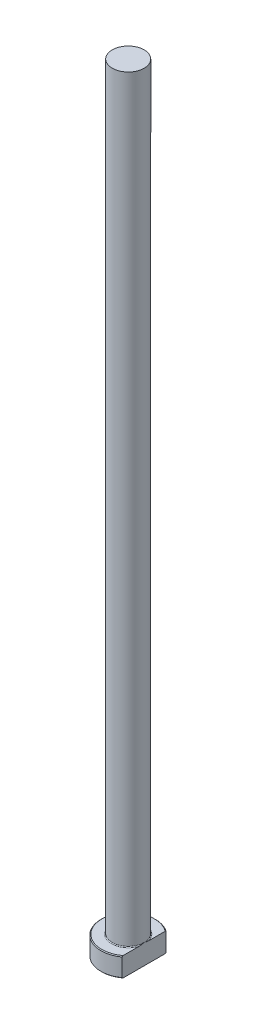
ISO-10303-21;
HEADER;
FILE_DESCRIPTION(('STEP AP214'),'2;1');
FILE_NAME('part.step','',(''),(''),'','','');
FILE_SCHEMA(('AUTOMOTIVE_DESIGN { 1 0 10303 214 1 1 1 1 }'));
ENDSEC;
DATA;
#1=APPLICATION_CONTEXT('core data for automotive mechanical design processes');
#2=APPLICATION_PROTOCOL_DEFINITION('international standard','automotive_design',2000,#1);
#3=PRODUCT_CONTEXT('',#1,'mechanical');
#4=PRODUCT('Part','Part','',(#3));
#5=PRODUCT_RELATED_PRODUCT_CATEGORY('part','',(#4));
#6=PRODUCT_DEFINITION_FORMATION('','',#4);
#7=PRODUCT_DEFINITION_CONTEXT('part definition',#1,'design');
#8=PRODUCT_DEFINITION('design','',#6,#7);
#9=PRODUCT_DEFINITION_SHAPE('','',#8);
#10=(LENGTH_UNIT() NAMED_UNIT(*) SI_UNIT(.MILLI.,.METRE.));
#11=(NAMED_UNIT(*) PLANE_ANGLE_UNIT() SI_UNIT($,.RADIAN.));
#12=(NAMED_UNIT(*) SI_UNIT($,.STERADIAN.) SOLID_ANGLE_UNIT());
#13=UNCERTAINTY_MEASURE_WITH_UNIT(LENGTH_MEASURE(1.E-05),#10,'distance_accuracy_value','');
#14=(GEOMETRIC_REPRESENTATION_CONTEXT(3) GLOBAL_UNCERTAINTY_ASSIGNED_CONTEXT((#13)) GLOBAL_UNIT_ASSIGNED_CONTEXT((#10,
#11,#12)) REPRESENTATION_CONTEXT('',''));
#15=CARTESIAN_POINT('',(0.,0.,0.));
#16=DIRECTION('',(0.,0.,1.));
#17=DIRECTION('',(1.,0.,0.));
#18=AXIS2_PLACEMENT_3D('',#15,#16,#17);
#19=CARTESIAN_POINT('',(0.,0.,0.));
#20=DIRECTION('',(0.,-1.,0.));
#21=DIRECTION('',(0.,0.,-1.));
#22=AXIS2_PLACEMENT_3D('',#19,#20,#21);
#23=PLANE('',#22);
#24=CARTESIAN_POINT('',(0.,0.,0.));
#25=DIRECTION('',(0.,-1.,0.));
#26=DIRECTION('',(0.,0.,-1.));
#27=AXIS2_PLACEMENT_3D('',#24,#25,#26);
#28=CIRCLE('',#27,6.79999999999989);
#29=CARTESIAN_POINT('',(4.09999999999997,0.,5.42494239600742));
#30=VERTEX_POINT('',#29);
#31=CARTESIAN_POINT('',(4.09999999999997,0.,-5.42494239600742));
#32=VERTEX_POINT('',#31);
#33=EDGE_CURVE('E98',#30,#32,#28,.T.);
#34=ORIENTED_EDGE('',*,*,#33,.T.);
#35=DIRECTION('',(0.,0.,1.));
#36=VECTOR('',#35,1.);
#37=CARTESIAN_POINT('',(4.09999999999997,0.,-5.6736231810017));
#38=LINE('',#37,#36);
#39=EDGE_CURVE('E83',#32,#30,#38,.T.);
#40=ORIENTED_EDGE('',*,*,#39,.T.);
#41=EDGE_LOOP('',(#34,#40));
#42=FACE_BOUND('',#41,.T.);
#43=ADVANCED_FACE('F32',(#42),#23,.T.);
#44=CARTESIAN_POINT('',(0.,259.958771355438,0.));
#45=DIRECTION('',(0.,1.,0.));
#46=DIRECTION('',(0.,0.,1.));
#47=AXIS2_PLACEMENT_3D('',#44,#45,#46);
#48=CYLINDRICAL_SURFACE('',#47,6.99999999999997);
#49=CARTESIAN_POINT('',(0.,4.79999999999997,0.));
#50=DIRECTION('',(0.,1.,0.));
#51=DIRECTION('',(0.,0.,1.));
#52=AXIS2_PLACEMENT_3D('',#49,#50,#51);
#53=CIRCLE('',#52,6.99999999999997);
#54=CARTESIAN_POINT('',(4.09999999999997,4.79999999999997,5.6736231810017));
#55=VERTEX_POINT('',#54);
#56=CARTESIAN_POINT('',(4.09999999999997,4.79999999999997,-5.6736231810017));
#57=VERTEX_POINT('',#56);
#58=EDGE_CURVE('E104',#55,#57,#53,.F.);
#59=ORIENTED_EDGE('',*,*,#58,.T.);
#60=DIRECTION('',(0.,-1.,0.));
#61=VECTOR('',#60,1.);
#62=CARTESIAN_POINT('',(4.09999999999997,200.,-5.6736231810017));
#63=LINE('',#62,#61);
#64=CARTESIAN_POINT('',(4.09999999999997,0.200000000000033,-5.6736231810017));
#65=VERTEX_POINT('',#64);
#66=EDGE_CURVE('E183',#57,#65,#63,.T.);
#67=ORIENTED_EDGE('',*,*,#66,.T.);
#68=CARTESIAN_POINT('',(0.,0.200000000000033,0.));
#69=DIRECTION('',(0.,-1.,0.));
#70=DIRECTION('',(0.,0.,-1.));
#71=AXIS2_PLACEMENT_3D('',#68,#69,#70);
#72=CIRCLE('',#71,6.99999999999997);
#73=CARTESIAN_POINT('',(4.09999999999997,0.200000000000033,5.6736231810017));
#74=VERTEX_POINT('',#73);
#75=EDGE_CURVE('E100',#65,#74,#72,.F.);
#76=ORIENTED_EDGE('',*,*,#75,.T.);
#77=DIRECTION('',(0.,-1.,0.));
#78=VECTOR('',#77,1.);
#79=CARTESIAN_POINT('',(4.09999999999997,200.,5.6736231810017));
#80=LINE('',#79,#78);
#81=EDGE_CURVE('E93',#55,#74,#80,.T.);
#82=ORIENTED_EDGE('',*,*,#81,.F.);
#83=EDGE_LOOP('',(#59,#67,#76,#82));
#84=FACE_BOUND('',#83,.T.);
#85=ADVANCED_FACE('F158',(#84),#48,.T.);
#86=CARTESIAN_POINT('',(-6.99999999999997,5.,0.));
#87=DIRECTION('',(0.,1.,0.));
#88=DIRECTION('',(0.,0.,1.));
#89=AXIS2_PLACEMENT_3D('',#86,#87,#88);
#90=PLANE('',#89);
#91=CARTESIAN_POINT('',(0.,5.,0.));
#92=DIRECTION('',(0.,1.,0.));
#93=DIRECTION('',(0.,0.,1.));
#94=AXIS2_PLACEMENT_3D('',#91,#92,#93);
#95=CIRCLE('',#94,6.79999999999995);
#96=CARTESIAN_POINT('',(4.09999999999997,5.,-5.4249423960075));
#97=VERTEX_POINT('',#96);
#98=CARTESIAN_POINT('',(4.09999999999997,5.,5.4249423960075));
#99=VERTEX_POINT('',#98);
#100=EDGE_CURVE('E178',#97,#99,#95,.T.);
#101=ORIENTED_EDGE('',*,*,#100,.T.);
#102=DIRECTION('',(0.,0.,-1.));
#103=VECTOR('',#102,1.);
#104=CARTESIAN_POINT('',(4.09999999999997,5.,0.));
#105=LINE('',#104,#103);
#106=CARTESIAN_POINT('',(4.09999999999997,4.99999999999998,1.29614813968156));
#107=VERTEX_POINT('',#106);
#108=EDGE_CURVE('E57',#99,#107,#105,.T.);
#109=ORIENTED_EDGE('',*,*,#108,.T.);
#110=CARTESIAN_POINT('',(0.,5.,0.));
#111=DIRECTION('',(0.,1.,0.));
#112=DIRECTION('',(0.,0.,1.));
#113=AXIS2_PLACEMENT_3D('',#110,#111,#112);
#114=CIRCLE('',#113,4.29999999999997);
#115=CARTESIAN_POINT('',(4.09999999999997,4.99999999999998,-1.29614813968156));
#116=VERTEX_POINT('',#115);
#117=EDGE_CURVE('E107',#107,#116,#114,.F.);
#118=ORIENTED_EDGE('',*,*,#117,.T.);
#119=EDGE_CURVE('E136',#116,#97,#105,.T.);
#120=ORIENTED_EDGE('',*,*,#119,.T.);
#121=EDGE_LOOP('',(#101,#109,#118,#120));
#122=FACE_BOUND('',#121,.T.);
#123=ADVANCED_FACE('F147',(#122),#90,.T.);
#124=CARTESIAN_POINT('',(0.,5.,0.));
#125=DIRECTION('',(0.,-1.,0.));
#126=DIRECTION('',(0.,0.,-1.));
#127=AXIS2_PLACEMENT_3D('',#124,#125,#126);
#128=CONICAL_SURFACE('',#127,6.79999999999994,0.785398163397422);
#129=ORIENTED_EDGE('',*,*,#58,.F.);
#130=CARTESIAN_POINT('',(4.09999999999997,-1.33929192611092,12.483228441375));
#131=CARTESIAN_POINT('',(4.09999999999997,-1.13691180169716,12.2702073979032));
#132=CARTESIAN_POINT('',(4.09999999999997,-0.934791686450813,12.0569390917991));
#133=CARTESIAN_POINT('',(4.09999999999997,-0.531169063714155,11.6298164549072));
#134=CARTESIAN_POINT('',(4.09999999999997,-0.329666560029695,11.4159621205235));
#135=CARTESIAN_POINT('',(4.09999999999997,0.273965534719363,10.7731725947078));
#136=CARTESIAN_POINT('',(4.09999999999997,0.675017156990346,10.3432236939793));
#137=CARTESIAN_POINT('',(4.09999999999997,1.47875431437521,9.47345436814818));
#138=CARTESIAN_POINT('',(4.09999999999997,1.88138218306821,9.03358046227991));
#139=CARTESIAN_POINT('',(4.09999999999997,2.48056970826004,8.36963259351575));
#140=CARTESIAN_POINT('',(4.09999999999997,2.67946853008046,8.14767042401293));
#141=CARTESIAN_POINT('',(4.09999999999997,3.07530374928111,7.70200314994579));
#142=CARTESIAN_POINT('',(4.09999999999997,3.27224016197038,7.47829805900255));
#143=CARTESIAN_POINT('',(4.09999999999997,3.62803580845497,7.06959504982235));
#144=CARTESIAN_POINT('',(4.09999999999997,3.78730687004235,6.88495594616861));
#145=CARTESIAN_POINT('',(4.09999999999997,4.10378434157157,6.51391771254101));
#146=CARTESIAN_POINT('',(4.09999999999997,4.26099077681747,6.32751860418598));
#147=CARTESIAN_POINT('',(4.09999999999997,4.57299335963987,5.95235210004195));
#148=CARTESIAN_POINT('',(4.09999999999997,4.72778657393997,5.7635822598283));
#149=CARTESIAN_POINT('',(4.09999999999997,5.03405385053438,5.38337519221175));
#150=CARTESIAN_POINT('',(4.09999999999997,5.18552806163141,5.191938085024));
#151=CARTESIAN_POINT('',(4.09999999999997,5.48381165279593,4.80616050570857));
#152=CARTESIAN_POINT('',(4.09999999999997,5.6306310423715,4.61182780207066));
#153=CARTESIAN_POINT('',(4.09999999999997,5.91857329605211,4.21889561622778));
#154=CARTESIAN_POINT('',(4.09999999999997,6.05969490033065,4.02029520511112));
#155=CARTESIAN_POINT('',(4.09999999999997,6.33384612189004,3.61807653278));
#156=CARTESIAN_POINT('',(4.09999999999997,6.46688994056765,3.41446801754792));
#157=CARTESIAN_POINT('',(4.09999999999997,6.7219628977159,3.00051329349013));
#158=CARTESIAN_POINT('',(4.09999999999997,6.84399822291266,2.79017096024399));
#159=CARTESIAN_POINT('',(4.09999999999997,7.042948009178,2.41613627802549));
#160=CARTESIAN_POINT('',(4.09999999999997,7.12340018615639,2.25434092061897));
#161=CARTESIAN_POINT('',(4.09999999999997,7.27278814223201,1.92538984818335));
#162=CARTESIAN_POINT('',(4.09999999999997,7.34172134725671,1.75823294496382));
#163=CARTESIAN_POINT('',(4.09999999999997,7.4639506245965,1.41984946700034));
#164=CARTESIAN_POINT('',(4.09999999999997,7.51737823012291,1.24867129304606));
#165=CARTESIAN_POINT('',(4.09999999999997,7.6053948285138,0.901532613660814));
#166=CARTESIAN_POINT('',(4.09999999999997,7.63999996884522,0.725576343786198));
#167=CARTESIAN_POINT('',(4.09999999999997,7.68036353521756,0.421086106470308));
#168=CARTESIAN_POINT('',(4.09999999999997,7.69152054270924,0.293260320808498));
#169=CARTESIAN_POINT('',(4.09999999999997,7.70182627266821,0.0371280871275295));
#170=CARTESIAN_POINT('',(4.09999999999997,7.7009769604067,-0.0911782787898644));
#171=CARTESIAN_POINT('',(4.09999999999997,7.68730446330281,-0.347367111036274));
#172=CARTESIAN_POINT('',(4.09999999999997,7.67446010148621,-0.475248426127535));
#173=CARTESIAN_POINT('',(4.09999999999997,7.63752967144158,-0.729373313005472));
#174=CARTESIAN_POINT('',(4.09999999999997,7.61344101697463,-0.85561650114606));
#175=CARTESIAN_POINT('',(4.09999999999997,7.54404317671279,-1.15392625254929));
#176=CARTESIAN_POINT('',(4.09999999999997,7.49413451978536,-1.32492035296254));
#177=CARTESIAN_POINT('',(4.09999999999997,7.37892989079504,-1.66161692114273));
#178=CARTESIAN_POINT('',(4.09999999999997,7.31362410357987,-1.82731593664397));
#179=CARTESIAN_POINT('',(4.09999999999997,7.17079959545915,-2.15435858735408));
#180=CARTESIAN_POINT('',(4.09999999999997,7.09321727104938,-2.31567410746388));
#181=CARTESIAN_POINT('',(4.09999999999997,6.97004119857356,-2.55403843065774));
#182=CARTESIAN_POINT('',(4.09999999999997,6.92785402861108,-2.63288278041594));
#183=CARTESIAN_POINT('',(4.09999999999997,6.84148468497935,-2.78946923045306));
#184=CARTESIAN_POINT('',(4.09999999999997,6.7973025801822,-2.8672113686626));
#185=CARTESIAN_POINT('',(4.09999999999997,6.65934609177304,-3.1037224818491));
#186=CARTESIAN_POINT('',(4.09999999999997,6.56274427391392,-3.26084376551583));
#187=CARTESIAN_POINT('',(4.09999999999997,6.36389133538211,-3.5714843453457));
#188=CARTESIAN_POINT('',(4.09999999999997,6.26163896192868,-3.72500283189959));
#189=CARTESIAN_POINT('',(4.09999999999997,6.05267831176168,-4.02913378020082));
#190=CARTESIAN_POINT('',(4.09999999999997,5.94596678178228,-4.17974399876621));
#191=CARTESIAN_POINT('',(4.09999999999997,5.72908222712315,-4.47845767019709));
#192=CARTESIAN_POINT('',(4.09999999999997,5.61890895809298,-4.62656094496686));
#193=CARTESIAN_POINT('',(4.09999999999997,5.39553225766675,-4.9210193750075));
#194=CARTESIAN_POINT('',(4.09999999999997,5.28232219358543,-5.06736948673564));
#195=CARTESIAN_POINT('',(4.09999999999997,5.05364560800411,-5.35829836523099));
#196=CARTESIAN_POINT('',(4.09999999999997,4.93817902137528,-5.50287708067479));
#197=CARTESIAN_POINT('',(4.09999999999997,4.58900487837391,-5.93440610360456));
#198=CARTESIAN_POINT('',(4.09999999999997,4.35254037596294,-6.21912657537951));
#199=CARTESIAN_POINT('',(4.09999999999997,3.99368021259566,-6.64336157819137));
#200=CARTESIAN_POINT('',(4.09999999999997,3.8731886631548,-6.78450136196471));
#201=CARTESIAN_POINT('',(4.09999999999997,3.63111125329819,-7.06582575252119));
#202=CARTESIAN_POINT('',(4.09999999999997,3.50952545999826,-7.20601041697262));
#203=CARTESIAN_POINT('',(4.09999999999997,3.14334067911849,-7.6253764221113));
#204=CARTESIAN_POINT('',(4.09999999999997,2.89734299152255,-7.90333600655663));
#205=CARTESIAN_POINT('',(4.09999999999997,2.40293836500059,-8.45636150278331));
#206=CARTESIAN_POINT('',(4.09999999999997,2.15453550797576,-8.73143107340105));
#207=CARTESIAN_POINT('',(4.09999999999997,1.65560568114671,-9.27963529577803));
#208=CARTESIAN_POINT('',(4.09999999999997,1.40507871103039,-9.55276994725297));
#209=CARTESIAN_POINT('',(4.09999999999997,0.947239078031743,-10.0488717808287));
#210=CARTESIAN_POINT('',(4.09999999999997,0.740197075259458,-10.2720890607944));
#211=CARTESIAN_POINT('',(4.09999999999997,0.325116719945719,-10.7177199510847));
#212=CARTESIAN_POINT('',(4.09999999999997,0.117078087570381,-10.940133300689));
#213=CARTESIAN_POINT('',(4.09999999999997,-0.298674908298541,-11.3830462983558));
#214=CARTESIAN_POINT('',(4.09999999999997,-0.506385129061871,-11.6035498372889));
#215=CARTESIAN_POINT('',(4.09999999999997,-0.922403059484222,-12.0438652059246));
#216=CARTESIAN_POINT('',(4.09999999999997,-1.13071056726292,-12.2636772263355));
#217=CARTESIAN_POINT('',(4.09999999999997,-1.33929192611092,-12.483228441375));
#218=B_SPLINE_CURVE_WITH_KNOTS('',3,(#130,#131,#132,#133,#134,#135,#136,#137,#138,#139,#140,
#141,#142,#143,#144,#145,#146,#147,#148,#149,#150,#151,#152,#153,#154,#155,#156,#157,#158,#159,
#160,#161,#162,#163,#164,#165,#166,#167,#168,#169,#170,#171,#172,#173,#174,#175,#176,#177,#178,
#179,#180,#181,#182,#183,#184,#185,#186,#187,#188,#189,#190,#191,#192,#193,#194,#195,#196,#197,
#198,#199,#200,#201,#202,#203,#204,#205,#206,#207,#208,#209,#210,#211,#212,#213,#214,#215,#216,
#217),.UNSPECIFIED.,.F.,.F.,(4,2,2,2,2,2,2,2,2,2,2,2,2,2,2,2,2,2,2,2,2,2,2,2,2,2,2,2,2,2,2,2,2,
2,2,2,2,2,2,2,2,2,2,4),(0.,0.881487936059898,1.76298129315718,3.52684938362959,5.31576438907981,
6.20987642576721,7.10398148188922,7.83549529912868,8.5670001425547,9.29933394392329,
10.0316348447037,10.7622363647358,11.4929985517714,12.2224363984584,12.9514617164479,
13.4932089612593,14.0350771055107,14.5722044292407,15.1088702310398,15.4932846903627,
15.8776362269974,16.2626676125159,16.6477876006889,17.1811942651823,17.7149418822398,
18.2515512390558,18.5197937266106,18.7880269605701,19.3411787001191,19.8944535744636,
20.448139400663,21.0018643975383,21.5569172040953,22.1119860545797,23.2222096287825,
23.7789368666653,24.335630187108,25.4491497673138,26.5610293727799,27.6729091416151,
28.5862688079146,29.4999020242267,30.4086844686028,31.3171893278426),.UNSPECIFIED.);
#219=EDGE_CURVE('E135',#55,#99,#218,.T.);
#220=ORIENTED_EDGE('',*,*,#219,.T.);
#221=ORIENTED_EDGE('',*,*,#100,.F.);
#222=EDGE_CURVE('E127',#97,#57,#218,.T.);
#223=ORIENTED_EDGE('',*,*,#222,.T.);
#224=EDGE_LOOP('',(#129,#220,#221,#223));
#225=FACE_BOUND('',#224,.T.);
#226=ADVANCED_FACE('F143',(#225),#128,.T.);
#227=CARTESIAN_POINT('',(0.,0.200000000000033,0.));
#228=DIRECTION('',(0.,1.,0.));
#229=DIRECTION('',(0.,0.,1.));
#230=AXIS2_PLACEMENT_3D('',#227,#228,#229);
#231=CONICAL_SURFACE('',#230,6.99999999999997,0.785398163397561);
#232=ORIENTED_EDGE('',*,*,#75,.F.);
#233=CARTESIAN_POINT('',(4.09999999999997,6.33929192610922,-12.483228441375));
#234=CARTESIAN_POINT('',(4.09999999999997,6.13691180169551,-12.2702073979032));
#235=CARTESIAN_POINT('',(4.09999999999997,5.93479168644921,-12.0569390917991));
#236=CARTESIAN_POINT('',(4.09999999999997,5.53116906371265,-11.6298164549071));
#237=CARTESIAN_POINT('',(4.09999999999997,5.32966656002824,-11.4159621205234));
#238=CARTESIAN_POINT('',(4.09999999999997,4.72603446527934,-10.7731725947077));
#239=CARTESIAN_POINT('',(4.09999999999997,4.32498284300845,-10.3432236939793));
#240=CARTESIAN_POINT('',(4.09999999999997,3.52124568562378,-9.47345436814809));
#241=CARTESIAN_POINT('',(4.09999999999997,3.11861781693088,-9.0335804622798));
#242=CARTESIAN_POINT('',(4.09999999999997,2.5194302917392,-8.36963259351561));
#243=CARTESIAN_POINT('',(4.09999999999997,2.32053146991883,-8.14767042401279));
#244=CARTESIAN_POINT('',(4.09999999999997,1.92469625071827,-7.70200314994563));
#245=CARTESIAN_POINT('',(4.09999999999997,1.72775983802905,-7.47829805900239));
#246=CARTESIAN_POINT('',(4.09999999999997,1.37196419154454,-7.06959504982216));
#247=CARTESIAN_POINT('',(4.09999999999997,1.2126931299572,-6.88495594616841));
#248=CARTESIAN_POINT('',(4.09999999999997,0.896215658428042,-6.51391771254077));
#249=CARTESIAN_POINT('',(4.09999999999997,0.739009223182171,-6.32751860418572));
#250=CARTESIAN_POINT('',(4.09999999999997,0.42700664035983,-5.95235210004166));
#251=CARTESIAN_POINT('',(4.09999999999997,0.272213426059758,-5.76358225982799));
#252=CARTESIAN_POINT('',(4.09999999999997,-0.0340538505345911,-5.38337519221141));
#253=CARTESIAN_POINT('',(4.09999999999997,-0.18552806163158,-5.19193808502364));
#254=CARTESIAN_POINT('',(4.09999999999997,-0.483811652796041,-4.80616050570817));
#255=CARTESIAN_POINT('',(4.09999999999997,-0.630631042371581,-4.61182780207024));
#256=CARTESIAN_POINT('',(4.09999999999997,-0.918573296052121,-4.21889561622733));
#257=CARTESIAN_POINT('',(4.09999999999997,-1.05969490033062,-4.02029520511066));
#258=CARTESIAN_POINT('',(4.09999999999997,-1.33384612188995,-3.61807653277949));
#259=CARTESIAN_POINT('',(4.09999999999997,-1.46688994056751,-3.4144680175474));
#260=CARTESIAN_POINT('',(4.09999999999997,-1.72196289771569,-3.00051329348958));
#261=CARTESIAN_POINT('',(4.09999999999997,-1.8439982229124,-2.79017096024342));
#262=CARTESIAN_POINT('',(4.09999999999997,-2.04294800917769,-2.41613627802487));
#263=CARTESIAN_POINT('',(4.09999999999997,-2.12340018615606,-2.2543409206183));
#264=CARTESIAN_POINT('',(4.09999999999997,-2.27278814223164,-1.92538984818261));
#265=CARTESIAN_POINT('',(4.09999999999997,-2.34172134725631,-1.75823294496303));
#266=CARTESIAN_POINT('',(4.09999999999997,-2.46395062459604,-1.41984946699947));
#267=CARTESIAN_POINT('',(4.09999999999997,-2.51737823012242,-1.24867129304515));
#268=CARTESIAN_POINT('',(4.09999999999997,-2.60539482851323,-0.901532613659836));
#269=CARTESIAN_POINT('',(4.09999999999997,-2.63999996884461,-0.725576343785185));
#270=CARTESIAN_POINT('',(4.09999999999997,-2.68036353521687,-0.421086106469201));
#271=CARTESIAN_POINT('',(4.09999999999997,-2.69152054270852,-0.293260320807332));
#272=CARTESIAN_POINT('',(4.09999999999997,-2.70182627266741,-0.0371280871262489));
#273=CARTESIAN_POINT('',(4.09999999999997,-2.70097696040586,0.0911782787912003));
#274=CARTESIAN_POINT('',(4.09999999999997,-2.68730446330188,0.347367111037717));
#275=CARTESIAN_POINT('',(4.09999999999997,-2.67446010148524,0.47524842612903));
#276=CARTESIAN_POINT('',(4.09999999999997,-2.63752967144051,0.729373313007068));
#277=CARTESIAN_POINT('',(4.09999999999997,-2.61344101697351,0.855616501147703));
#278=CARTESIAN_POINT('',(4.09999999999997,-2.54404317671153,1.15392625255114));
#279=CARTESIAN_POINT('',(4.09999999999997,-2.494134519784,1.32492035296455));
#280=CARTESIAN_POINT('',(4.09999999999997,-2.37892989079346,1.66161692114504));
#281=CARTESIAN_POINT('',(4.09999999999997,-2.31362410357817,1.82731593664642));
#282=CARTESIAN_POINT('',(4.09999999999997,-2.17079959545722,2.15435858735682));
#283=CARTESIAN_POINT('',(4.09999999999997,-2.09321727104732,2.31567410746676));
#284=CARTESIAN_POINT('',(4.09999999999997,-1.97004119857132,2.55403843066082));
#285=CARTESIAN_POINT('',(4.09999999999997,-1.92785402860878,2.63288278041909));
#286=CARTESIAN_POINT('',(4.09999999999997,-1.84148468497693,2.78946923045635));
#287=CARTESIAN_POINT('',(4.09999999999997,-1.79730258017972,2.86721136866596));
#288=CARTESIAN_POINT('',(4.09999999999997,-1.65934609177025,3.10372248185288));
#289=CARTESIAN_POINT('',(4.09999999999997,-1.56274427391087,3.26084376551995));
#290=CARTESIAN_POINT('',(4.09999999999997,-1.36389133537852,3.5714843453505));
#291=CARTESIAN_POINT('',(4.09999999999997,-1.26163896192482,3.72500283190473));
#292=CARTESIAN_POINT('',(4.09999999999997,-1.05267831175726,4.02913378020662));
#293=CARTESIAN_POINT('',(4.09999999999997,-0.945966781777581,4.17974399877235));
#294=CARTESIAN_POINT('',(4.09999999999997,-0.729082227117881,4.47845767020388));
#295=CARTESIAN_POINT('',(4.09999999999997,-0.618908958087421,4.62656094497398));
#296=CARTESIAN_POINT('',(4.09999999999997,-0.395532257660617,4.92101937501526));
#297=CARTESIAN_POINT('',(4.09999999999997,-0.282322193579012,5.06736948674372));
#298=CARTESIAN_POINT('',(4.09999999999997,-0.0536456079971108,5.35829836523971));
#299=CARTESIAN_POINT('',(4.09999999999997,0.0618209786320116,5.50287708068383));
#300=CARTESIAN_POINT('',(4.09999999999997,0.410995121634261,5.93440610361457));
#301=CARTESIAN_POINT('',(4.09999999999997,0.64745962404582,6.21912657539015));
#302=CARTESIAN_POINT('',(4.09999999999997,1.00631978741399,6.64336157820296));
#303=CARTESIAN_POINT('',(4.09999999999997,1.12681133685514,6.78450136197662));
#304=CARTESIAN_POINT('',(4.09999999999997,1.36888874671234,7.06582575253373));
#305=CARTESIAN_POINT('',(4.09999999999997,1.49047454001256,7.20601041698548));
#306=CARTESIAN_POINT('',(4.09999999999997,1.8566593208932,7.6253764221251));
#307=CARTESIAN_POINT('',(4.09999999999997,2.10265700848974,7.90333600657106));
#308=CARTESIAN_POINT('',(4.09999999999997,2.59706163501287,8.45636150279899));
#309=CARTESIAN_POINT('',(4.09999999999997,2.84546449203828,8.73143107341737));
#310=CARTESIAN_POINT('',(4.09999999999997,3.3443943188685,9.27963529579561));
#311=CARTESIAN_POINT('',(4.09999999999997,3.5949212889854,9.55276994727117));
#312=CARTESIAN_POINT('',(4.09999999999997,4.05276092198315,10.0488717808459));
#313=CARTESIAN_POINT('',(4.09999999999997,4.25980292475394,10.27208906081));
#314=CARTESIAN_POINT('',(4.09999999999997,4.67488328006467,10.7177199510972));
#315=CARTESIAN_POINT('',(4.09999999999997,4.8829219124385,10.9401333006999));
#316=CARTESIAN_POINT('',(4.09999999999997,5.2986749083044,11.3830462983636));
#317=CARTESIAN_POINT('',(4.09999999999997,5.50638512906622,11.603549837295));
#318=CARTESIAN_POINT('',(4.09999999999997,5.92240305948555,12.0438652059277));
#319=CARTESIAN_POINT('',(4.09999999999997,6.13071056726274,12.263677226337));
#320=CARTESIAN_POINT('',(4.09999999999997,6.33929192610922,12.483228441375));
#321=B_SPLINE_CURVE_WITH_KNOTS('',3,(#233,#234,#235,#236,#237,#238,#239,#240,#241,#242,#243,
#244,#245,#246,#247,#248,#249,#250,#251,#252,#253,#254,#255,#256,#257,#258,#259,#260,#261,#262,
#263,#264,#265,#266,#267,#268,#269,#270,#271,#272,#273,#274,#275,#276,#277,#278,#279,#280,#281,
#282,#283,#284,#285,#286,#287,#288,#289,#290,#291,#292,#293,#294,#295,#296,#297,#298,#299,#300,
#301,#302,#303,#304,#305,#306,#307,#308,#309,#310,#311,#312,#313,#314,#315,#316,#317,#318,#319,
#320),.UNSPECIFIED.,.F.,.F.,(4,2,2,2,2,2,2,2,2,2,2,2,2,2,2,2,2,2,2,2,2,2,2,2,2,2,2,2,2,2,2,2,2,
2,2,2,2,2,2,2,2,2,2,4),(0.,0.88148793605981,1.76298129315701,3.52684938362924,5.31576438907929,
6.20987642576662,7.10398148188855,7.83549529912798,8.56700014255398,9.29933394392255,
10.031634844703,10.762236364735,11.4929985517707,12.2224363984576,12.9514617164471,
13.4932089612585,14.03507710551,14.5722044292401,15.1088702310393,15.4932846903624,
15.8776362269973,16.2626676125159,16.6477876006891,17.181194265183,17.7149418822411,
18.2515512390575,18.5197937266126,18.7880269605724,19.3411787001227,19.8944535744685,
20.4481394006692,21.0018643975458,21.5569172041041,22.1119860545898,23.2222096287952,
23.7789368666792,24.3356301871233,25.4491497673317,26.5610293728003,27.6729091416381,
28.5862688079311,29.4999020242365,30.4086844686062,31.3171893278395),.UNSPECIFIED.);
#322=EDGE_CURVE('E86',#65,#32,#321,.T.);
#323=ORIENTED_EDGE('',*,*,#322,.T.);
#324=ORIENTED_EDGE('',*,*,#33,.F.);
#325=EDGE_CURVE('E89',#30,#74,#321,.T.);
#326=ORIENTED_EDGE('',*,*,#325,.T.);
#327=EDGE_LOOP('',(#232,#323,#324,#326));
#328=FACE_BOUND('',#327,.T.);
#329=ADVANCED_FACE('F97',(#328),#231,.T.);
#330=CARTESIAN_POINT('',(0.,5.19999999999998,0.));
#331=DIRECTION('',(0.,1.,0.));
#332=DIRECTION('',(0.,0.,1.));
#333=AXIS2_PLACEMENT_3D('',#330,#331,#332);
#334=TOROIDAL_SURFACE('',#333,4.29999999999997,0.2);
#335=CARTESIAN_POINT('',(4.09999999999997,5.19999999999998,0.));
#336=CARTESIAN_POINT('',(4.09999999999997,5.20000051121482,8.48177579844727E-11));
#337=CARTESIAN_POINT('',(4.09999999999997,5.2000010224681,-2.37341874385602E-07));
#338=CARTESIAN_POINT('',(4.09999999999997,5.20000197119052,-8.69991321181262E-07));
#339=CARTESIAN_POINT('',(4.09999999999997,5.20000238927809,-1.28223494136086E-06));
#340=CARTESIAN_POINT('',(4.09999999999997,5.20000327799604,-2.27653388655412E-06));
#341=CARTESIAN_POINT('',(4.09999999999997,5.20000373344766,-2.87471299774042E-06));
#342=CARTESIAN_POINT('',(4.09999999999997,5.20000453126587,-4.09830357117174E-06));
#343=CARTESIAN_POINT('',(4.09999999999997,5.20000487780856,-4.72126748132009E-06));
#344=CARTESIAN_POINT('',(4.09999999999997,5.20000620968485,-7.19543436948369E-06));
#345=CARTESIAN_POINT('',(4.09999999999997,5.20000713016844,-9.08507628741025E-06));
#346=CARTESIAN_POINT('',(4.09999999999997,5.20000860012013,-1.27786167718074E-05));
#347=CARTESIAN_POINT('',(4.09999999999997,5.2000091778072,-1.45716794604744E-05));
#348=CARTESIAN_POINT('',(4.09999999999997,5.20001167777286,-2.23278313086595E-05));
#349=CARTESIAN_POINT('',(4.09999999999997,5.20001360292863,-2.82919348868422E-05));
#350=CARTESIAN_POINT('',(4.09999999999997,5.20001636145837,-3.94393207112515E-05));
#351=CARTESIAN_POINT('',(4.09999999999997,5.20001732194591,-4.459065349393E-05));
#352=CARTESIAN_POINT('',(4.09999999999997,5.20002443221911,-8.33481274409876E-05));
#353=CARTESIAN_POINT('',(4.09999999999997,5.20002995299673,-0.000117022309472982));
#354=CARTESIAN_POINT('',(4.09999999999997,5.20005411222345,-0.000250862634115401));
#355=CARTESIAN_POINT('',(4.09999999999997,5.20007702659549,-0.000350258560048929));
#356=CARTESIAN_POINT('',(4.09999999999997,5.20016686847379,-0.000745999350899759));
#357=CARTESIAN_POINT('',(4.09999999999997,5.20023113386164,-0.00104273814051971));
#358=CARTESIAN_POINT('',(4.09999999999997,5.20048975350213,-0.00222871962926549));
#359=CARTESIAN_POINT('',(4.09999999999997,5.20068752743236,-0.00311743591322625));
#360=CARTESIAN_POINT('',(4.09999999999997,5.20151360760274,-0.00683863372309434));
#361=CARTESIAN_POINT('',(4.09999999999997,5.20213761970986,-0.00967177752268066));
#362=CARTESIAN_POINT('',(4.09999999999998,5.21060513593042,-0.0481053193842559));
#363=CARTESIAN_POINT('',(4.09999999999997,5.21847514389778,-0.0837019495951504));
#364=CARTESIAN_POINT('',(4.09999999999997,5.23497753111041,-0.15888321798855));
#365=CARTESIAN_POINT('',(4.09999999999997,5.24359721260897,-0.198470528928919));
#366=CARTESIAN_POINT('',(4.09999999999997,5.25810552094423,-0.266014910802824));
#367=CARTESIAN_POINT('',(4.09999999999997,5.26405008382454,-0.293959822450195));
#368=CARTESIAN_POINT('',(4.09999999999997,5.27562355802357,-0.34912552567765));
#369=CARTESIAN_POINT('',(4.09999999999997,5.28125665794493,-0.376345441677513));
#370=CARTESIAN_POINT('',(4.09999999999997,5.29943979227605,-0.46575599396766));
#371=CARTESIAN_POINT('',(4.09999999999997,5.31159607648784,-0.528028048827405));
#372=CARTESIAN_POINT('',(4.09999999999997,5.3345183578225,-0.653452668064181));
#373=CARTESIAN_POINT('',(4.09999999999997,5.34526982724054,-0.716607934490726));
#374=CARTESIAN_POINT('',(4.09999999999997,5.36549989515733,-0.849208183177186));
#375=CARTESIAN_POINT('',(4.09999999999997,5.37476398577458,-0.918686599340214));
#376=CARTESIAN_POINT('',(4.09999999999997,5.38955225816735,-1.05786044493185));
#377=CARTESIAN_POINT('',(4.09999999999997,5.39508786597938,-1.12755454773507));
#378=CARTESIAN_POINT('',(4.09999999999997,5.3992964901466,-1.23112590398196));
#379=CARTESIAN_POINT('',(4.09999999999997,5.40003705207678,-1.26491756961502));
#380=CARTESIAN_POINT('',(4.09999999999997,5.39995996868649,-1.33249559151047));
#381=CARTESIAN_POINT('',(4.09999999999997,5.39914270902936,-1.36628194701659));
#382=CARTESIAN_POINT('',(4.09999999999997,5.39557880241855,-1.43339843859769));
#383=CARTESIAN_POINT('',(4.09999999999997,5.39285312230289,-1.46672955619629));
#384=CARTESIAN_POINT('',(4.09999999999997,5.3849220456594,-1.53304911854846));
#385=CARTESIAN_POINT('',(4.09999999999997,5.37972044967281,-1.56603800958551));
#386=CARTESIAN_POINT('',(4.09999999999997,5.36576321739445,-1.63210333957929));
#387=CARTESIAN_POINT('',(4.09999999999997,5.35693238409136,-1.66516593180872));
#388=CARTESIAN_POINT('',(4.09999999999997,5.33956496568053,-1.71313701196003));
#389=CARTESIAN_POINT('',(4.09999999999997,5.33312382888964,-1.72879572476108));
#390=CARTESIAN_POINT('',(4.09999999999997,5.31841020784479,-1.75921181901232));
#391=CARTESIAN_POINT('',(4.09999999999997,5.31014484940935,-1.77397243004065));
#392=CARTESIAN_POINT('',(4.09999999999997,5.29597609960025,-1.79459137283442));
#393=CARTESIAN_POINT('',(4.09999999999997,5.29105059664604,-1.80111732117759));
#394=CARTESIAN_POINT('',(4.09999999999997,5.28047159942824,-1.81356806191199));
#395=CARTESIAN_POINT('',(4.09999999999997,5.27481806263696,-1.81949281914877));
#396=CARTESIAN_POINT('',(4.09999999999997,5.26378662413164,-1.82942177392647));
#397=CARTESIAN_POINT('',(4.09999999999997,5.25854825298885,-1.83357893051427));
#398=CARTESIAN_POINT('',(4.09999999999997,5.24747881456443,-1.8410175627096));
#399=CARTESIAN_POINT('',(4.09999999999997,5.24164898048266,-1.84430081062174));
#400=CARTESIAN_POINT('',(4.09999999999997,5.23103019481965,-1.84897077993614));
#401=CARTESIAN_POINT('',(4.09999999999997,5.22636142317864,-1.85062832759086));
#402=CARTESIAN_POINT('',(4.09999999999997,5.21681344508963,-1.85314556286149));
#403=CARTESIAN_POINT('',(4.09999999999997,5.21193447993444,-1.85400614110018));
#404=CARTESIAN_POINT('',(4.09999999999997,5.2020790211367,-1.8548454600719));
#405=CARTESIAN_POINT('',(4.09999999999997,5.19710220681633,-1.85482052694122));
#406=CARTESIAN_POINT('',(4.09999999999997,5.18723254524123,-1.85388227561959));
#407=CARTESIAN_POINT('',(4.09999999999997,5.18233974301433,-1.8529684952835));
#408=CARTESIAN_POINT('',(4.09999999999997,5.17301169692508,-1.85041011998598));
#409=CARTESIAN_POINT('',(4.09999999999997,5.16856577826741,-1.84880345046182));
#410=CARTESIAN_POINT('',(4.09999999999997,5.15994310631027,-1.84499014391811));
#411=CARTESIAN_POINT('',(4.09999999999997,5.15576643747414,-1.84278331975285));
#412=CARTESIAN_POINT('',(4.09999999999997,5.1448604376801,-1.83616140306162));
#413=CARTESIAN_POINT('',(4.09999999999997,5.13841060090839,-1.8312871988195));
#414=CARTESIAN_POINT('',(4.09999999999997,5.12632402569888,-1.82061430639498));
#415=CARTESIAN_POINT('',(4.09999999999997,5.12069027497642,-1.81481237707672));
#416=CARTESIAN_POINT('',(4.09999999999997,5.10569835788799,-1.79748307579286));
#417=CARTESIAN_POINT('',(4.09999999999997,5.0971810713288,-1.78523612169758));
#418=CARTESIAN_POINT('',(4.09999999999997,5.08190874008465,-1.759730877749));
#419=CARTESIAN_POINT('',(4.09999999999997,5.07515617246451,-1.74647119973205));
#420=CARTESIAN_POINT('',(4.09999999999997,5.06057670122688,-1.71404296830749));
#421=CARTESIAN_POINT('',(4.09999999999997,5.05336936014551,-1.69459894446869));
#422=CARTESIAN_POINT('',(4.09999999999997,5.04078670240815,-1.65511361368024));
#423=CARTESIAN_POINT('',(4.09999999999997,5.03541518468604,-1.63507116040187));
#424=CARTESIAN_POINT('',(4.09999999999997,5.02602669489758,-1.59438056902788));
#425=CARTESIAN_POINT('',(4.09999999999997,5.02202979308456,-1.57372787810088));
#426=CARTESIAN_POINT('',(4.09999999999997,5.01520764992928,-1.53226128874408));
#427=CARTESIAN_POINT('',(4.09999999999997,5.01238102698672,-1.51144761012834));
#428=CARTESIAN_POINT('',(4.09999999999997,5.00618826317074,-1.45642510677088));
#429=CARTESIAN_POINT('',(4.09999999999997,5.00362476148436,-1.42212636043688));
#430=CARTESIAN_POINT('',(4.09999999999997,5.00045800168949,-1.35343324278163));
#431=CARTESIAN_POINT('',(4.09999999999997,4.99985588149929,-1.31903882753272));
#432=CARTESIAN_POINT('',(4.09999999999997,5.00037893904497,-1.21560964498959));
#433=CARTESIAN_POINT('',(4.09999999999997,5.00385566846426,-1.14658832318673));
#434=CARTESIAN_POINT('',(4.09999999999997,5.01464295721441,-1.01357004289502));
#435=CARTESIAN_POINT('',(4.09999999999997,5.02167983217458,-0.949547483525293));
#436=CARTESIAN_POINT('',(4.09999999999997,5.03833051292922,-0.822416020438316));
#437=CARTESIAN_POINT('',(4.09999999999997,5.04792112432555,-0.759304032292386));
#438=CARTESIAN_POINT('',(4.09999999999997,5.06649836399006,-0.648156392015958));
#439=CARTESIAN_POINT('',(4.09999999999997,5.07509963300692,-0.60005440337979));
#440=CARTESIAN_POINT('',(4.09999999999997,5.09336865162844,-0.5027171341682));
#441=CARTESIAN_POINT('',(4.09999999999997,5.10305882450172,-0.45348607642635));
#442=CARTESIAN_POINT('',(4.09999999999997,5.12010265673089,-0.369650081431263));
#443=CARTESIAN_POINT('',(4.09999999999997,5.1273025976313,-0.335013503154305));
#444=CARTESIAN_POINT('',(4.09999999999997,5.14184386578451,-0.26617579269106));
#445=CARTESIAN_POINT('',(4.09999999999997,5.14918270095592,-0.231974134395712));
#446=CARTESIAN_POINT('',(4.09999999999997,5.16314314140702,-0.167541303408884));
#447=CARTESIAN_POINT('',(4.09999999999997,5.16974991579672,-0.137306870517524));
#448=CARTESIAN_POINT('',(4.09999999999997,5.18332308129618,-0.0755506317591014));
#449=CARTESIAN_POINT('',(4.09999999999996,5.19029270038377,-0.0440294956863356));
#450=CARTESIAN_POINT('',(4.09999999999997,5.19786353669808,-0.00966658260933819));
#451=CARTESIAN_POINT('',(4.09999999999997,5.19848867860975,-0.00682823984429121));
#452=CARTESIAN_POINT('',(4.09999999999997,5.19931502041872,-0.00310588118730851));
#453=CARTESIAN_POINT('',(4.09999999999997,5.19951189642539,-0.00222119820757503));
#454=CARTESIAN_POINT('',(4.09999999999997,5.19976942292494,-0.00104022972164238));
#455=CARTESIAN_POINT('',(4.09999999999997,5.19983347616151,-0.000744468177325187));
#456=CARTESIAN_POINT('',(4.09999999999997,5.19992306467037,-0.000349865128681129));
#457=CARTESIAN_POINT('',(4.09999999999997,5.1999459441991,-0.000250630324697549));
#458=CARTESIAN_POINT('',(4.09999999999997,5.19997007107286,-0.000116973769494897));
#459=CARTESIAN_POINT('',(4.09999999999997,5.19997558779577,-8.33211280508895E-05));
#460=CARTESIAN_POINT('',(4.09999999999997,5.19998268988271,-4.45857715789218E-05));
#461=CARTESIAN_POINT('',(4.09999999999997,5.19998364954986,-3.94355404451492E-05));
#462=CARTESIAN_POINT('',(4.09999999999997,5.19998640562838,-2.82904942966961E-05));
#463=CARTESIAN_POINT('',(4.09999999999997,5.19998832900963,-2.23275713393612E-05));
#464=CARTESIAN_POINT('',(4.09999999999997,5.19999082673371,-1.45726655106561E-05));
#465=CARTESIAN_POINT('',(4.09999999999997,5.19999140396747,-1.27796833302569E-05));
#466=CARTESIAN_POINT('',(4.09999999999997,5.19999287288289,-9.08623741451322E-06));
#467=CARTESIAN_POINT('',(4.09999999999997,5.19999379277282,-7.19659802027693E-06));
#468=CARTESIAN_POINT('',(4.09999999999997,5.19999512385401,-4.72235852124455E-06));
#469=CARTESIAN_POINT('',(4.09999999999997,5.1999954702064,-4.0993503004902E-06));
#470=CARTESIAN_POINT('',(4.09999999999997,5.19999626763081,-2.87563677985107E-06));
#471=CARTESIAN_POINT('',(4.09999999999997,5.19999672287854,-2.2773772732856E-06));
#472=CARTESIAN_POINT('',(4.09999999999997,5.19999761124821,-1.28289389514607E-06));
#473=CARTESIAN_POINT('',(4.09999999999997,5.19999802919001,-8.70554048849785E-07));
#474=CARTESIAN_POINT('',(4.09999999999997,5.19999897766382,-2.3765555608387E-07));
#475=CARTESIAN_POINT('',(4.09999999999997,5.19999948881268,-8.48131903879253E-11));
#476=CARTESIAN_POINT('',(4.09999999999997,5.19999999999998,0.));
#477=B_SPLINE_CURVE_WITH_KNOTS('',3,(#335,#336,#337,#338,#339,#340,#341,#342,#343,#344,#345,
#346,#347,#348,#349,#350,#351,#352,#353,#354,#355,#356,#357,#358,#359,#360,#361,#362,#363,#364,
#365,#366,#367,#368,#369,#370,#371,#372,#373,#374,#375,#376,#377,#378,#379,#380,#381,#382,#383,
#384,#385,#386,#387,#388,#389,#390,#391,#392,#393,#394,#395,#396,#397,#398,#399,#400,#401,#402,
#403,#404,#405,#406,#407,#408,#409,#410,#411,#412,#413,#414,#415,#416,#417,#418,#419,#420,#421,
#422,#423,#424,#425,#426,#427,#428,#429,#430,#431,#432,#433,#434,#435,#436,#437,#438,#439,#440,
#441,#442,#443,#444,#445,#446,#447,#448,#449,#450,#451,#452,#453,#454,#455,#456,#457,#458,#459,
#460,#461,#462,#463,#464,#465,#466,#467,#468,#469,#470,#471,#472,#473,#474,#475,#476),
.UNSPECIFIED.,.T.,.F.,(4,2,2,2,2,2,2,2,2,2,2,2,2,2,2,2,2,2,2,2,2,2,2,2,2,2,2,2,2,2,2,2,2,2,2,2,
2,2,2,2,2,2,2,2,2,2,2,2,2,2,2,2,2,2,2,2,2,2,2,2,2,2,2,2,2,2,2,2,2,2,4),(0.,1.56077961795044E-06,
3.3330233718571E-06,5.57220089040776E-06,7.71031786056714E-06,1.39959462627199E-05,
1.96420817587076E-05,3.84177478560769E-05,5.41207073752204E-05,0.000156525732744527,
0.000462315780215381,0.00137340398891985,0.00410448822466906,0.0128079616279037,
0.122174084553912,0.243719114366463,0.329429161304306,0.41281904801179,0.603149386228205,
0.795314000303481,1.0055338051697,1.21510641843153,1.31647802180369,1.41782453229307,
1.51807472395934,1.61817152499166,1.72045618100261,1.77118252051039,1.82171411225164,
1.84620451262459,1.87069634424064,1.89069743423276,1.91065764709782,1.92546132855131,
1.94024844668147,1.9550969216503,1.96995312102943,1.98408278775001,1.99821686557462,
2.02232905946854,2.04652741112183,2.09102796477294,2.13559065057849,2.19765435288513,
2.25984571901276,2.32290998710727,2.38589958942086,2.489000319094,2.59216085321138,
2.79925959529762,2.99242441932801,3.18389136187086,3.33047882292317,3.48099951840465,
3.58712985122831,3.69206963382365,3.78491369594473,3.88175875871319,3.89047819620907,
3.89319688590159,3.89410497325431,3.89441026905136,3.8945126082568,3.89452830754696,
3.8945470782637,3.89455272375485,3.89455900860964,3.89456114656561,3.89456338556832,
3.8945651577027,3.89456671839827),.UNSPECIFIED.);
#478=CARTESIAN_POINT('',(4.09999999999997,5.19999999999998,0.));
#479=VERTEX_POINT('',#478);
#480=EDGE_CURVE('E11',#116,#479,#477,.T.);
#481=ORIENTED_EDGE('',*,*,#480,.F.);
#482=ORIENTED_EDGE('',*,*,#117,.F.);
#483=CARTESIAN_POINT('',(4.09999999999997,5.19999999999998,0.));
#484=CARTESIAN_POINT('',(4.09999999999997,5.19999948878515,-8.48181322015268E-11));
#485=CARTESIAN_POINT('',(4.09999999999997,5.19999897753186,2.37341874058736E-07));
#486=CARTESIAN_POINT('',(4.09999999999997,5.19999802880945,8.69991321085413E-07));
#487=CARTESIAN_POINT('',(4.09999999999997,5.19999761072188,1.28223494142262E-06));
#488=CARTESIAN_POINT('',(4.09999999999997,5.19999672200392,2.27653388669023E-06));
#489=CARTESIAN_POINT('',(4.09999999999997,5.1999962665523,2.874712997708E-06));
#490=CARTESIAN_POINT('',(4.09999999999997,5.19999546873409,4.0983035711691E-06));
#491=CARTESIAN_POINT('',(4.09999999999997,5.1999951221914,4.72126748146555E-06));
#492=CARTESIAN_POINT('',(4.09999999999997,5.19999379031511,7.19543437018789E-06));
#493=CARTESIAN_POINT('',(4.09999999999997,5.19999286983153,9.0850762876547E-06));
#494=CARTESIAN_POINT('',(4.09999999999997,5.19999139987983,1.27786167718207E-05));
#495=CARTESIAN_POINT('',(4.09999999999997,5.19999082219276,1.45716794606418E-05));
#496=CARTESIAN_POINT('',(4.09999999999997,5.1999883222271,2.2327831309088E-05));
#497=CARTESIAN_POINT('',(4.09999999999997,5.19998639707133,2.82919348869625E-05));
#498=CARTESIAN_POINT('',(4.09999999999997,5.19998363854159,3.94393207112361E-05));
#499=CARTESIAN_POINT('',(4.09999999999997,5.19998267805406,4.45906534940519E-05));
#500=CARTESIAN_POINT('',(4.09999999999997,5.19997556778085,8.33481274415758E-05));
#501=CARTESIAN_POINT('',(4.09999999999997,5.19997004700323,0.000117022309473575));
#502=CARTESIAN_POINT('',(4.09999999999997,5.19994588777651,0.000250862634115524));
#503=CARTESIAN_POINT('',(4.09999999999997,5.19992297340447,0.000350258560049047));
#504=CARTESIAN_POINT('',(4.09999999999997,5.19983313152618,0.000745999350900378));
#505=CARTESIAN_POINT('',(4.09999999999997,5.19976886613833,0.00104273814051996));
#506=CARTESIAN_POINT('',(4.09999999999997,5.19951024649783,0.00222871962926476));
#507=CARTESIAN_POINT('',(4.09999999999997,5.1993124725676,0.00311743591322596));
#508=CARTESIAN_POINT('',(4.09999999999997,5.19848639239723,0.00683863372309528));
#509=CARTESIAN_POINT('',(4.09999999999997,5.19786238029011,0.0096717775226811));
#510=CARTESIAN_POINT('',(4.09999999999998,5.18939486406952,0.0481053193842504));
#511=CARTESIAN_POINT('',(4.09999999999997,5.18152485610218,0.0837019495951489));
#512=CARTESIAN_POINT('',(4.09999999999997,5.16502246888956,0.158883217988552));
#513=CARTESIAN_POINT('',(4.09999999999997,5.156402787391,0.19847052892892));
#514=CARTESIAN_POINT('',(4.09999999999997,5.14189447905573,0.266014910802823));
#515=CARTESIAN_POINT('',(4.09999999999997,5.13594991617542,0.293959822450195));
#516=CARTESIAN_POINT('',(4.09999999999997,5.12437644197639,0.34912552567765));
#517=CARTESIAN_POINT('',(4.09999999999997,5.11874334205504,0.376345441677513));
#518=CARTESIAN_POINT('',(4.09999999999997,5.10056020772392,0.46575599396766));
#519=CARTESIAN_POINT('',(4.09999999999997,5.08840392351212,0.528028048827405));
#520=CARTESIAN_POINT('',(4.09999999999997,5.06548164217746,0.65345266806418));
#521=CARTESIAN_POINT('',(4.09999999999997,5.05473017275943,0.716607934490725));
#522=CARTESIAN_POINT('',(4.09999999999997,5.03450010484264,0.849208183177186));
#523=CARTESIAN_POINT('',(4.09999999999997,5.02523601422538,0.918686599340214));
#524=CARTESIAN_POINT('',(4.09999999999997,5.01044774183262,1.05786044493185));
#525=CARTESIAN_POINT('',(4.09999999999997,5.00491213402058,1.12755454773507));
#526=CARTESIAN_POINT('',(4.09999999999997,5.00070350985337,1.23112590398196));
#527=CARTESIAN_POINT('',(4.09999999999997,4.99996294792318,1.26491756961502));
#528=CARTESIAN_POINT('',(4.09999999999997,5.00004003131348,1.33249559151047));
#529=CARTESIAN_POINT('',(4.09999999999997,5.00085729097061,1.36628194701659));
#530=CARTESIAN_POINT('',(4.09999999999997,5.00442119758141,1.43339843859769));
#531=CARTESIAN_POINT('',(4.09999999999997,5.00714687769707,1.46672955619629));
#532=CARTESIAN_POINT('',(4.09999999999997,5.01507795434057,1.53304911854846));
#533=CARTESIAN_POINT('',(4.09999999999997,5.02027955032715,1.56603800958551));
#534=CARTESIAN_POINT('',(4.09999999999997,5.03423678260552,1.63210333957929));
#535=CARTESIAN_POINT('',(4.09999999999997,5.04306761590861,1.66516593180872));
#536=CARTESIAN_POINT('',(4.09999999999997,5.06043503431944,1.71313701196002));
#537=CARTESIAN_POINT('',(4.09999999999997,5.06687617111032,1.72879572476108));
#538=CARTESIAN_POINT('',(4.09999999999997,5.08158979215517,1.75921181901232));
#539=CARTESIAN_POINT('',(4.09999999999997,5.08985515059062,1.77397243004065));
#540=CARTESIAN_POINT('',(4.09999999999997,5.10402390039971,1.79459137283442));
#541=CARTESIAN_POINT('',(4.09999999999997,5.10894940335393,1.8011173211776));
#542=CARTESIAN_POINT('',(4.09999999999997,5.11952840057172,1.81356806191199));
#543=CARTESIAN_POINT('',(4.09999999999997,5.12518193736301,1.81949281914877));
#544=CARTESIAN_POINT('',(4.09999999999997,5.13621337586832,1.82942177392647));
#545=CARTESIAN_POINT('',(4.09999999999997,5.14145174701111,1.83357893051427));
#546=CARTESIAN_POINT('',(4.09999999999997,5.15252118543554,1.8410175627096));
#547=CARTESIAN_POINT('',(4.09999999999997,5.1583510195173,1.84430081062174));
#548=CARTESIAN_POINT('',(4.09999999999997,5.16896980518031,1.84897077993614));
#549=CARTESIAN_POINT('',(4.09999999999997,5.17363857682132,1.85062832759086));
#550=CARTESIAN_POINT('',(4.09999999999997,5.18318655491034,1.85314556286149));
#551=CARTESIAN_POINT('',(4.09999999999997,5.18806552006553,1.85400614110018));
#552=CARTESIAN_POINT('',(4.09999999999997,5.19792097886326,1.8548454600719));
#553=CARTESIAN_POINT('',(4.09999999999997,5.20289779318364,1.85482052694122));
#554=CARTESIAN_POINT('',(4.09999999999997,5.21276745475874,1.85388227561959));
#555=CARTESIAN_POINT('',(4.09999999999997,5.21766025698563,1.8529684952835));
#556=CARTESIAN_POINT('',(4.09999999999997,5.22698830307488,1.85041011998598));
#557=CARTESIAN_POINT('',(4.09999999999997,5.23143422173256,1.84880345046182));
#558=CARTESIAN_POINT('',(4.09999999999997,5.2400568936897,1.84499014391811));
#559=CARTESIAN_POINT('',(4.09999999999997,5.24423356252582,1.84278331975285));
#560=CARTESIAN_POINT('',(4.09999999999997,5.25513956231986,1.83616140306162));
#561=CARTESIAN_POINT('',(4.09999999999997,5.26158939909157,1.8312871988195));
#562=CARTESIAN_POINT('',(4.09999999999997,5.27367597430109,1.82061430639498));
#563=CARTESIAN_POINT('',(4.09999999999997,5.27930972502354,1.81481237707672));
#564=CARTESIAN_POINT('',(4.09999999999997,5.29430164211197,1.79748307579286));
#565=CARTESIAN_POINT('',(4.09999999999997,5.30281892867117,1.78523612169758));
#566=CARTESIAN_POINT('',(4.09999999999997,5.31809125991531,1.759730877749));
#567=CARTESIAN_POINT('',(4.09999999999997,5.32484382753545,1.74647119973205));
#568=CARTESIAN_POINT('',(4.09999999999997,5.33942329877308,1.71404296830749));
#569=CARTESIAN_POINT('',(4.09999999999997,5.34663063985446,1.69459894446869));
#570=CARTESIAN_POINT('',(4.09999999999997,5.35921329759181,1.65511361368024));
#571=CARTESIAN_POINT('',(4.09999999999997,5.36458481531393,1.63507116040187));
#572=CARTESIAN_POINT('',(4.09999999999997,5.37397330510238,1.59438056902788));
#573=CARTESIAN_POINT('',(4.09999999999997,5.3779702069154,1.57372787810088));
#574=CARTESIAN_POINT('',(4.09999999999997,5.38479235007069,1.53226128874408));
#575=CARTESIAN_POINT('',(4.09999999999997,5.38761897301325,1.51144761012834));
#576=CARTESIAN_POINT('',(4.09999999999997,5.39381173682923,1.45642510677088));
#577=CARTESIAN_POINT('',(4.09999999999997,5.3963752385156,1.42212636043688));
#578=CARTESIAN_POINT('',(4.09999999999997,5.39954199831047,1.35343324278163));
#579=CARTESIAN_POINT('',(4.09999999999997,5.40014411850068,1.31903882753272));
#580=CARTESIAN_POINT('',(4.09999999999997,5.39962106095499,1.21560964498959));
#581=CARTESIAN_POINT('',(4.09999999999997,5.3961443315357,1.14658832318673));
#582=CARTESIAN_POINT('',(4.09999999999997,5.38535704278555,1.01357004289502));
#583=CARTESIAN_POINT('',(4.09999999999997,5.37832016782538,0.949547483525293));
#584=CARTESIAN_POINT('',(4.09999999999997,5.36166948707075,0.822416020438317));
#585=CARTESIAN_POINT('',(4.09999999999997,5.35207887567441,0.759304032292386));
#586=CARTESIAN_POINT('',(4.09999999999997,5.33350163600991,0.648156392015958));
#587=CARTESIAN_POINT('',(4.09999999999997,5.32490036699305,0.60005440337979));
#588=CARTESIAN_POINT('',(4.09999999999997,5.30663134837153,0.5027171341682));
#589=CARTESIAN_POINT('',(4.09999999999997,5.29694117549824,0.453486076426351));
#590=CARTESIAN_POINT('',(4.09999999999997,5.27989734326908,0.369650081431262));
#591=CARTESIAN_POINT('',(4.09999999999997,5.27269740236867,0.335013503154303));
#592=CARTESIAN_POINT('',(4.09999999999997,5.25815613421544,0.266175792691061));
#593=CARTESIAN_POINT('',(4.09999999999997,5.25081729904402,0.231974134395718));
#594=CARTESIAN_POINT('',(4.09999999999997,5.23685685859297,0.167541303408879));
#595=CARTESIAN_POINT('',(4.09999999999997,5.23025008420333,0.137306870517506));
#596=CARTESIAN_POINT('',(4.09999999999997,5.21667691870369,0.0755506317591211));
#597=CARTESIAN_POINT('',(4.09999999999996,5.20970729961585,0.0440294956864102));
#598=CARTESIAN_POINT('',(4.09999999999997,5.20213646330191,0.00966658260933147));
#599=CARTESIAN_POINT('',(4.09999999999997,5.20151132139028,0.00682823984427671));
#600=CARTESIAN_POINT('',(4.09999999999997,5.20068497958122,0.00310588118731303));
#601=CARTESIAN_POINT('',(4.09999999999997,5.20048810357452,0.00222119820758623));
#602=CARTESIAN_POINT('',(4.09999999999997,5.20023057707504,0.00104022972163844));
#603=CARTESIAN_POINT('',(4.09999999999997,5.2001665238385,0.000744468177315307));
#604=CARTESIAN_POINT('',(4.09999999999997,5.20007693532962,0.000349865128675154));
#605=CARTESIAN_POINT('',(4.09999999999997,5.20005405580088,0.000250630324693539));
#606=CARTESIAN_POINT('',(4.09999999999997,5.20002992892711,0.000116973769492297));
#607=CARTESIAN_POINT('',(4.09999999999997,5.20002441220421,8.33211280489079E-05));
#608=CARTESIAN_POINT('',(4.09999999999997,5.20001731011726,4.45857715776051E-05));
#609=CARTESIAN_POINT('',(4.09999999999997,5.20001635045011,3.94355404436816E-05));
#610=CARTESIAN_POINT('',(4.09999999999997,5.20001359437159,2.82904942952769E-05));
#611=CARTESIAN_POINT('',(4.09999999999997,5.20001167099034,2.23275713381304E-05));
#612=CARTESIAN_POINT('',(4.09999999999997,5.20000917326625,1.45726655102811E-05));
#613=CARTESIAN_POINT('',(4.09999999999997,5.2000085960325,1.27796833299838E-05));
#614=CARTESIAN_POINT('',(4.09999999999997,5.20000712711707,9.08623741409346E-06));
#615=CARTESIAN_POINT('',(4.09999999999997,5.20000620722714,7.19659801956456E-06));
#616=CARTESIAN_POINT('',(4.09999999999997,5.20000487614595,4.72235852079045E-06));
#617=CARTESIAN_POINT('',(4.09999999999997,5.20000452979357,4.09935030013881E-06));
#618=CARTESIAN_POINT('',(4.09999999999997,5.20000373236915,2.875636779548E-06));
#619=CARTESIAN_POINT('',(4.09999999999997,5.20000327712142,2.27737727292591E-06));
#620=CARTESIAN_POINT('',(4.09999999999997,5.20000238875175,1.28289389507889E-06));
#621=CARTESIAN_POINT('',(4.09999999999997,5.20000197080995,8.7055404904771E-07));
#622=CARTESIAN_POINT('',(4.09999999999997,5.20000102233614,2.37655556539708E-07));
#623=CARTESIAN_POINT('',(4.09999999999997,5.20000051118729,8.48135644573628E-11));
#624=CARTESIAN_POINT('',(4.09999999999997,5.19999999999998,0.));
#625=B_SPLINE_CURVE_WITH_KNOTS('',3,(#483,#484,#485,#486,#487,#488,#489,#490,#491,#492,#493,
#494,#495,#496,#497,#498,#499,#500,#501,#502,#503,#504,#505,#506,#507,#508,#509,#510,#511,#512,
#513,#514,#515,#516,#517,#518,#519,#520,#521,#522,#523,#524,#525,#526,#527,#528,#529,#530,#531,
#532,#533,#534,#535,#536,#537,#538,#539,#540,#541,#542,#543,#544,#545,#546,#547,#548,#549,#550,
#551,#552,#553,#554,#555,#556,#557,#558,#559,#560,#561,#562,#563,#564,#565,#566,#567,#568,#569,
#570,#571,#572,#573,#574,#575,#576,#577,#578,#579,#580,#581,#582,#583,#584,#585,#586,#587,#588,
#589,#590,#591,#592,#593,#594,#595,#596,#597,#598,#599,#600,#601,#602,#603,#604,#605,#606,#607,
#608,#609,#610,#611,#612,#613,#614,#615,#616,#617,#618,#619,#620,#621,#622,#623,#624),
.UNSPECIFIED.,.T.,.F.,(4,2,2,2,2,2,2,2,2,2,2,2,2,2,2,2,2,2,2,2,2,2,2,2,2,2,2,2,2,2,2,2,2,2,2,2,
2,2,2,2,2,2,2,2,2,2,2,2,2,2,2,2,2,2,2,2,2,2,2,2,2,2,2,2,2,2,2,2,2,2,4),(0.,1.56077961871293E-06,
3.33302337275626E-06,5.5722008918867E-06,7.71031786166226E-06,1.3995946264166E-05,
1.9642081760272E-05,3.84177478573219E-05,5.41207073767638E-05,0.000156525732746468,
0.00046231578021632,0.00137340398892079,0.00410448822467,0.0128079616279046,0.122174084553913,
0.243719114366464,0.329429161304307,0.412819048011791,0.603149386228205,0.795314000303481,
1.0055338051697,1.21510641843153,1.31647802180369,1.41782453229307,1.51807472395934,
1.61817152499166,1.72045618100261,1.77118252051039,1.82171411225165,1.8462045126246,
1.87069634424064,1.89069743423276,1.91065764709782,1.92546132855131,1.94024844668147,
1.9550969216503,1.96995312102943,1.98408278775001,1.99821686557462,2.02232905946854,
2.04652741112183,2.09102796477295,2.13559065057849,2.19765435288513,2.25984571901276,
2.32290998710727,2.38589958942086,2.489000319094,2.59216085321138,2.79925959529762,
2.99242441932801,3.18389136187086,3.33047882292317,3.48099951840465,3.58712985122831,
3.69206963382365,3.78491369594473,3.88175875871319,3.89047819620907,3.89319688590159,
3.89410497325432,3.89441026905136,3.8945126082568,3.89452830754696,3.8945470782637,
3.89455272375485,3.89455900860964,3.89456114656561,3.89456338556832,3.89456515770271,
3.89456671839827),.UNSPECIFIED.);
#626=EDGE_CURVE('E46',#479,#107,#625,.T.);
#627=ORIENTED_EDGE('',*,*,#626,.F.);
#628=CARTESIAN_POINT('',(0.,5.19999999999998,0.));
#629=DIRECTION('',(0.,1.,0.));
#630=DIRECTION('',(0.,0.,1.));
#631=AXIS2_PLACEMENT_3D('',#628,#629,#630);
#632=CIRCLE('',#631,4.09999999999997);
#633=EDGE_CURVE('E103',#479,#479,#632,.T.);
#634=ORIENTED_EDGE('',*,*,#633,.F.);
#635=EDGE_LOOP('',(#481,#482,#627,#634));
#636=FACE_BOUND('',#635,.T.);
#637=ADVANCED_FACE('F34',(#636),#334,.F.);
#638=CARTESIAN_POINT('',(0.,259.958771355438,0.));
#639=DIRECTION('',(0.,1.,0.));
#640=DIRECTION('',(0.,0.,1.));
#641=AXIS2_PLACEMENT_3D('',#638,#639,#640);
#642=CYLINDRICAL_SURFACE('',#641,4.09999999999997);
#643=ORIENTED_EDGE('',*,*,#633,.T.);
#644=EDGE_LOOP('',(#643));
#645=FACE_BOUND('',#644,.T.);
#646=CARTESIAN_POINT('',(0.,200.,0.));
#647=DIRECTION('',(0.,1.,0.));
#648=DIRECTION('',(0.,0.,1.));
#649=AXIS2_PLACEMENT_3D('',#646,#647,#648);
#650=CIRCLE('',#649,4.09999999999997);
#651=CARTESIAN_POINT('',(0.,200.,4.09999999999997));
#652=VERTEX_POINT('',#651);
#653=EDGE_CURVE('E101',#652,#652,#650,.T.);
#654=ORIENTED_EDGE('',*,*,#653,.F.);
#655=EDGE_LOOP('',(#654));
#656=FACE_BOUND('',#655,.T.);
#657=ADVANCED_FACE('F155',(#645,#656),#642,.T.);
#658=CARTESIAN_POINT('',(-4.09999999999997,200.,0.));
#659=DIRECTION('',(0.,1.,0.));
#660=DIRECTION('',(0.,0.,1.));
#661=AXIS2_PLACEMENT_3D('',#658,#659,#660);
#662=PLANE('',#661);
#663=ORIENTED_EDGE('',*,*,#653,.T.);
#664=EDGE_LOOP('',(#663));
#665=FACE_BOUND('',#664,.T.);
#666=ADVANCED_FACE('F121',(#665),#662,.T.);
#667=CARTESIAN_POINT('',(4.09999999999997,200.,-5.6736231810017));
#668=DIRECTION('',(1.,0.,0.));
#669=DIRECTION('',(0.,0.,-1.));
#670=AXIS2_PLACEMENT_3D('',#667,#668,#669);
#671=PLANE('',#670);
#672=ORIENTED_EDGE('',*,*,#66,.F.);
#673=ORIENTED_EDGE('',*,*,#222,.F.);
#674=ORIENTED_EDGE('',*,*,#119,.F.);
#675=ORIENTED_EDGE('',*,*,#480,.T.);
#676=ORIENTED_EDGE('',*,*,#626,.T.);
#677=ORIENTED_EDGE('',*,*,#108,.F.);
#678=ORIENTED_EDGE('',*,*,#219,.F.);
#679=ORIENTED_EDGE('',*,*,#81,.T.);
#680=ORIENTED_EDGE('',*,*,#325,.F.);
#681=ORIENTED_EDGE('',*,*,#39,.F.);
#682=ORIENTED_EDGE('',*,*,#322,.F.);
#683=EDGE_LOOP('',(#672,#673,#674,#675,#676,#677,#678,#679,#680,#681,#682));
#684=FACE_BOUND('',#683,.T.);
#685=ADVANCED_FACE('F85',(#684),#671,.T.);
#686=CLOSED_SHELL('',(#43,#85,#123,#226,#329,#637,#657,#666,#685));
#687=MANIFOLD_SOLID_BREP('B2',#686);
#688=ADVANCED_BREP_SHAPE_REPRESENTATION('',(#18,#687),#14);
#689=SHAPE_DEFINITION_REPRESENTATION(#9,#688);
ENDSEC;
END-ISO-10303-21;
